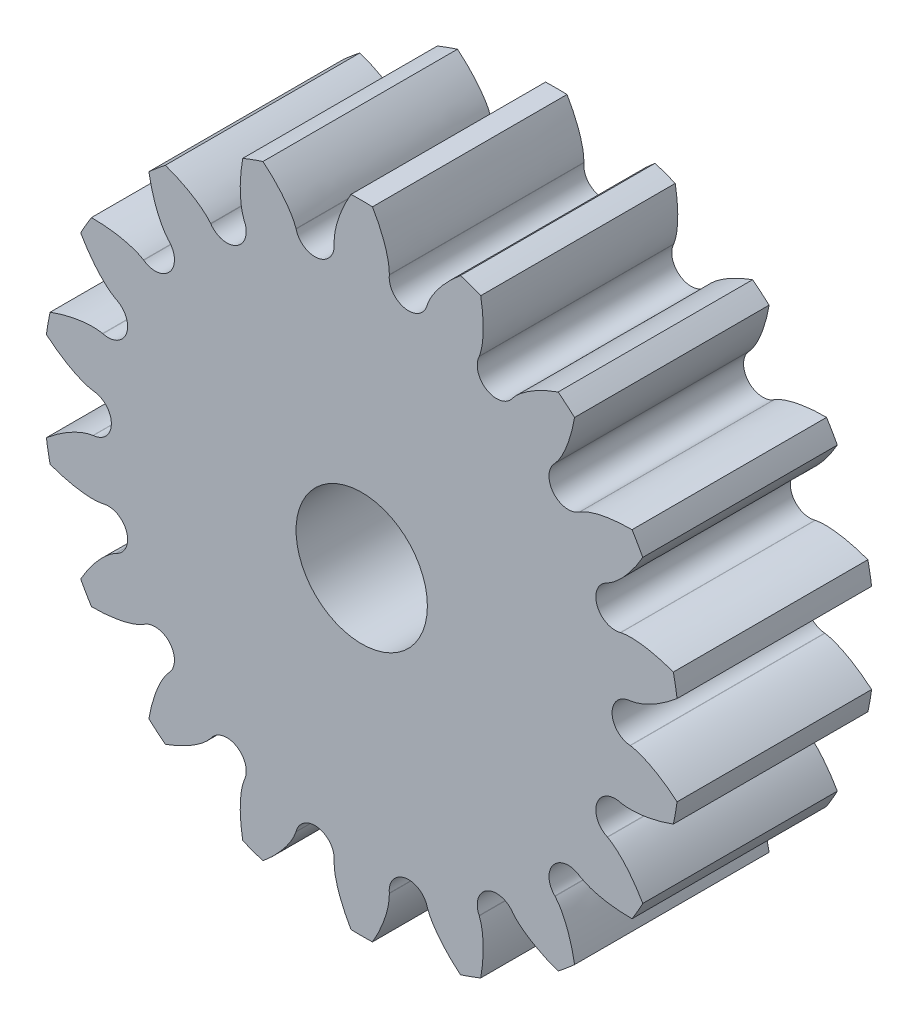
from build123d import *

# Parameters (mm, degrees)
SKETCH3_R                      = 3.8735
SKETCH3_R_2                    = 1.016
BASE_DEPTH                     = 3.0099
HALF_TOOTH_DEPTH               = 3.0099
PATTERN_OF_TOOTH_COUNT         = 18
PATTERN_OF_TOOTH_COPY_1_DEPTH  = 3.0099
PATTERN_OF_TOOTH_COPY_2_DEPTH  = 3.0099
PATTERN_OF_TOOTH_COPY_3_DEPTH  = 3.0099
PATTERN_OF_TOOTH_COPY_4_DEPTH  = 3.0099
PATTERN_OF_TOOTH_COPY_5_DEPTH  = 3.0099
PATTERN_OF_TOOTH_COPY_6_DEPTH  = 3.0099
PATTERN_OF_TOOTH_COPY_7_DEPTH  = 3.0099
PATTERN_OF_TOOTH_COPY_8_DEPTH  = 3.0099
PATTERN_OF_TOOTH_COPY_9_DEPTH  = 3.0099
PATTERN_OF_TOOTH_COPY_10_DEPTH = 3.0099
PATTERN_OF_TOOTH_COPY_11_DEPTH = 3.0099
PATTERN_OF_TOOTH_COPY_12_DEPTH = 3.0099
PATTERN_OF_TOOTH_COPY_13_DEPTH = 3.0099
PATTERN_OF_TOOTH_COPY_14_DEPTH = 3.0099
PATTERN_OF_TOOTH_COPY_15_DEPTH = 3.0099
PATTERN_OF_TOOTH_COPY_16_DEPTH = 3.0099
PATTERN_OF_TOOTH_COPY_17_DEPTH = 3.0099


with BuildPart() as part:
    # Sketch3 → Base (new body)
    with BuildSketch(Plane.XY):
        Circle(SKETCH3_R)
        Circle(SKETCH3_R_2, mode=Mode.SUBTRACT)
    extrude(amount=BASE_DEPTH)

    # Sketch2 → Half tooth (add)
    with BuildSketch(Plane.XY):
        with BuildLine():
            Line((0, 4.9276), (0, 3.8735))
            ThreePointArc((0, 3.8735), (0.33759777, 3.858760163), (0.672626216, 3.814652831))
            ThreePointArc((0.672626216, 3.814652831), (0.485562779, 3.929154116), (0.426627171, 4.14041194))
            Line((0.426627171, 4.14041194), (0.427145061, 4.145438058))
            add(Edge.make_bspline(
                [(0.166315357, 4.924792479), (0.258862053, 4.766378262), (0.375827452, 4.512802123), (0.428422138, 4.238585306), (0.427145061, 4.145438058)],
                knots=[0, 0, 0, 0, 0.664051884, 1, 1, 1, 1], degree=3))
            ThreePointArc((0.166315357, 4.924792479), (0.083169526, 4.92689807), (0, 4.9276))
        make_face()
    half_tooth = extrude(amount=HALF_TOOTH_DEPTH)

    # Mirror of half tooth: Half tooth across plane
    add(half_tooth.mirror(Plane.ZY))

    # Pattern of tooth: Half tooth ×18 about axis
    pattern_of_tooth_axis = Axis((0, 0, 0), (0, 0, -1))
    for i in range(1, PATTERN_OF_TOOTH_COUNT):
        add(half_tooth.rotate(pattern_of_tooth_axis, i * 360 / PATTERN_OF_TOOTH_COUNT))

    # Pattern of tooth copy 1 sketch → Pattern of tooth copy 1 (add)
    with BuildSketch(Plane(origin=(0, 0, 0), x_dir=(-0.9396926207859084, 0.3420201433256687, 0), z_dir=(0, 0, 1))):
        with BuildLine():
            Line((0, -4.9276), (0, -3.8735))
            ThreePointArc((0, -3.8735), (0.33759777, -3.858760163), (0.672626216, -3.814652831))
            ThreePointArc((0.672626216, -3.814652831), (0.485562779, -3.929154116), (0.426627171, -4.14041194))
            Line((0.426627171, -4.14041194), (0.427145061, -4.145438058))
            add(Edge.make_bspline(
                [(0.166315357, -4.924792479), (0.258862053, -4.766378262), (0.375827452, -4.512802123), (0.428422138, -4.238585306), (0.427145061, -4.145438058)],
                knots=[0, 0, 0, 0, 0.664051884, 1, 1, 1, 1], degree=3))
            ThreePointArc((0.166315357, -4.924792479), (0.083169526, -4.92689807), (0, -4.9276))
        make_face()
    extrude(amount=PATTERN_OF_TOOTH_COPY_1_DEPTH)

    # Pattern of tooth copy 2 sketch → Pattern of tooth copy 2 (add)
    with BuildSketch(Plane(origin=(0, 0, 0), x_dir=(-0.766044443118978, 0.6427876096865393, 0), z_dir=(0, 0, 1))):
        with BuildLine():
            Line((0, -4.9276), (0, -3.8735))
            ThreePointArc((0, -3.8735), (0.33759777, -3.858760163), (0.672626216, -3.814652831))
            ThreePointArc((0.672626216, -3.814652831), (0.485562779, -3.929154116), (0.426627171, -4.14041194))
            Line((0.426627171, -4.14041194), (0.427145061, -4.145438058))
            add(Edge.make_bspline(
                [(0.166315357, -4.924792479), (0.258862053, -4.766378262), (0.375827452, -4.512802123), (0.428422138, -4.238585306), (0.427145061, -4.145438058)],
                knots=[0, 0, 0, 0, 0.664051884, 1, 1, 1, 1], degree=3))
            ThreePointArc((0.166315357, -4.924792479), (0.083169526, -4.92689807), (0, -4.9276))
        make_face()
    extrude(amount=PATTERN_OF_TOOTH_COPY_2_DEPTH)

    # Pattern of tooth copy 3 sketch → Pattern of tooth copy 3 (add)
    with BuildSketch(Plane(origin=(0, 0, 0), x_dir=(-0.5000000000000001, 0.8660254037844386, 0), z_dir=(0, 0, 1))):
        with BuildLine():
            Line((0, -4.9276), (0, -3.8735))
            ThreePointArc((0, -3.8735), (0.33759777, -3.858760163), (0.672626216, -3.814652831))
            ThreePointArc((0.672626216, -3.814652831), (0.485562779, -3.929154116), (0.426627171, -4.14041194))
            Line((0.426627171, -4.14041194), (0.427145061, -4.145438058))
            add(Edge.make_bspline(
                [(0.166315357, -4.924792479), (0.258862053, -4.766378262), (0.375827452, -4.512802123), (0.428422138, -4.238585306), (0.427145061, -4.145438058)],
                knots=[0, 0, 0, 0, 0.664051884, 1, 1, 1, 1], degree=3))
            ThreePointArc((0.166315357, -4.924792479), (0.083169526, -4.92689807), (0, -4.9276))
        make_face()
    extrude(amount=PATTERN_OF_TOOTH_COPY_3_DEPTH)

    # Pattern of tooth copy 4 sketch → Pattern of tooth copy 4 (add)
    with BuildSketch(Plane(origin=(0, 0, 0), x_dir=(-0.17364817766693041, 0.984807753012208, 0), z_dir=(0, 0, 1))):
        with BuildLine():
            Line((0, -4.9276), (0, -3.8735))
            ThreePointArc((0, -3.8735), (0.33759777, -3.858760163), (0.672626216, -3.814652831))
            ThreePointArc((0.672626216, -3.814652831), (0.485562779, -3.929154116), (0.426627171, -4.14041194))
            Line((0.426627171, -4.14041194), (0.427145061, -4.145438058))
            add(Edge.make_bspline(
                [(0.166315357, -4.924792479), (0.258862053, -4.766378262), (0.375827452, -4.512802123), (0.428422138, -4.238585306), (0.427145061, -4.145438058)],
                knots=[0, 0, 0, 0, 0.664051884, 1, 1, 1, 1], degree=3))
            ThreePointArc((0.166315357, -4.924792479), (0.083169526, -4.92689807), (0, -4.9276))
        make_face()
    extrude(amount=PATTERN_OF_TOOTH_COPY_4_DEPTH)

    # Pattern of tooth copy 5 sketch → Pattern of tooth copy 5 (add)
    with BuildSketch(Plane(origin=(0, 0, 0), x_dir=(0.1736481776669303, 0.984807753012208, 0), z_dir=(0, 0, 1))):
        with BuildLine():
            Line((0, -4.9276), (0, -3.8735))
            ThreePointArc((0, -3.8735), (0.33759777, -3.858760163), (0.672626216, -3.814652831))
            ThreePointArc((0.672626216, -3.814652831), (0.485562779, -3.929154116), (0.426627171, -4.14041194))
            Line((0.426627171, -4.14041194), (0.427145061, -4.145438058))
            add(Edge.make_bspline(
                [(0.166315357, -4.924792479), (0.258862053, -4.766378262), (0.375827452, -4.512802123), (0.428422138, -4.238585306), (0.427145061, -4.145438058)],
                knots=[0, 0, 0, 0, 0.664051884, 1, 1, 1, 1], degree=3))
            ThreePointArc((0.166315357, -4.924792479), (0.083169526, -4.92689807), (0, -4.9276))
        make_face()
    extrude(amount=PATTERN_OF_TOOTH_COPY_5_DEPTH)

    # Pattern of tooth copy 6 sketch → Pattern of tooth copy 6 (add)
    with BuildSketch(Plane(origin=(0, 0, 0), x_dir=(0.4999999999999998, 0.8660254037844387, 0), z_dir=(0, 0, 1))):
        with BuildLine():
            Line((0, -4.9276), (0, -3.8735))
            ThreePointArc((0, -3.8735), (0.33759777, -3.858760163), (0.672626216, -3.814652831))
            ThreePointArc((0.672626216, -3.814652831), (0.485562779, -3.929154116), (0.426627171, -4.14041194))
            Line((0.426627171, -4.14041194), (0.427145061, -4.145438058))
            add(Edge.make_bspline(
                [(0.166315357, -4.924792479), (0.258862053, -4.766378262), (0.375827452, -4.512802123), (0.428422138, -4.238585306), (0.427145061, -4.145438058)],
                knots=[0, 0, 0, 0, 0.664051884, 1, 1, 1, 1], degree=3))
            ThreePointArc((0.166315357, -4.924792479), (0.083169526, -4.92689807), (0, -4.9276))
        make_face()
    extrude(amount=PATTERN_OF_TOOTH_COPY_6_DEPTH)

    # Pattern of tooth copy 7 sketch → Pattern of tooth copy 7 (add)
    with BuildSketch(Plane(origin=(0, 0, 0), x_dir=(0.7660444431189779, 0.6427876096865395, 0), z_dir=(0, 0, 1))):
        with BuildLine():
            Line((0, -4.9276), (0, -3.8735))
            ThreePointArc((0, -3.8735), (0.33759777, -3.858760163), (0.672626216, -3.814652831))
            ThreePointArc((0.672626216, -3.814652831), (0.485562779, -3.929154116), (0.426627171, -4.14041194))
            Line((0.426627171, -4.14041194), (0.427145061, -4.145438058))
            add(Edge.make_bspline(
                [(0.166315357, -4.924792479), (0.258862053, -4.766378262), (0.375827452, -4.512802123), (0.428422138, -4.238585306), (0.427145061, -4.145438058)],
                knots=[0, 0, 0, 0, 0.664051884, 1, 1, 1, 1], degree=3))
            ThreePointArc((0.166315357, -4.924792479), (0.083169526, -4.92689807), (0, -4.9276))
        make_face()
    extrude(amount=PATTERN_OF_TOOTH_COPY_7_DEPTH)

    # Pattern of tooth copy 8 sketch → Pattern of tooth copy 8 (add)
    with BuildSketch(Plane(origin=(0, 0, 0), x_dir=(0.9396926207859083, 0.3420201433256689, 0), z_dir=(0, 0, 1))):
        with BuildLine():
            Line((0, -4.9276), (0, -3.8735))
            ThreePointArc((0, -3.8735), (0.33759777, -3.858760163), (0.672626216, -3.814652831))
            ThreePointArc((0.672626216, -3.814652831), (0.485562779, -3.929154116), (0.426627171, -4.14041194))
            Line((0.426627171, -4.14041194), (0.427145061, -4.145438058))
            add(Edge.make_bspline(
                [(0.166315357, -4.924792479), (0.258862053, -4.766378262), (0.375827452, -4.512802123), (0.428422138, -4.238585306), (0.427145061, -4.145438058)],
                knots=[0, 0, 0, 0, 0.664051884, 1, 1, 1, 1], degree=3))
            ThreePointArc((0.166315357, -4.924792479), (0.083169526, -4.92689807), (0, -4.9276))
        make_face()
    extrude(amount=PATTERN_OF_TOOTH_COPY_8_DEPTH)

    # Pattern of tooth copy 9 sketch → Pattern of tooth copy 9 (add)
    with BuildSketch(Plane.XY):
        with BuildLine():
            Line((0, -4.9276), (0, -3.8735))
            ThreePointArc((0, -3.8735), (0.33759777, -3.858760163), (0.672626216, -3.814652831))
            ThreePointArc((0.672626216, -3.814652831), (0.485562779, -3.929154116), (0.426627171, -4.14041194))
            Line((0.426627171, -4.14041194), (0.427145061, -4.145438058))
            add(Edge.make_bspline(
                [(0.166315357, -4.924792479), (0.258862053, -4.766378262), (0.375827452, -4.512802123), (0.428422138, -4.238585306), (0.427145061, -4.145438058)],
                knots=[0, 0, 0, 0, 0.664051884, 1, 1, 1, 1], degree=3))
            ThreePointArc((0.166315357, -4.924792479), (0.083169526, -4.92689807), (0, -4.9276))
        make_face()
    extrude(amount=PATTERN_OF_TOOTH_COPY_9_DEPTH)

    # Pattern of tooth copy 10 sketch → Pattern of tooth copy 10 (add)
    with BuildSketch(Plane(origin=(0, 0, 0), x_dir=(0.9396926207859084, -0.34202014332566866, 0), z_dir=(0, 0, 1))):
        with BuildLine():
            Line((0, -4.9276), (0, -3.8735))
            ThreePointArc((0, -3.8735), (0.33759777, -3.858760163), (0.672626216, -3.814652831))
            ThreePointArc((0.672626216, -3.814652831), (0.485562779, -3.929154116), (0.426627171, -4.14041194))
            Line((0.426627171, -4.14041194), (0.427145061, -4.145438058))
            add(Edge.make_bspline(
                [(0.166315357, -4.924792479), (0.258862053, -4.766378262), (0.375827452, -4.512802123), (0.428422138, -4.238585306), (0.427145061, -4.145438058)],
                knots=[0, 0, 0, 0, 0.664051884, 1, 1, 1, 1], degree=3))
            ThreePointArc((0.166315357, -4.924792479), (0.083169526, -4.92689807), (0, -4.9276))
        make_face()
    extrude(amount=PATTERN_OF_TOOTH_COPY_10_DEPTH)

    # Pattern of tooth copy 11 sketch → Pattern of tooth copy 11 (add)
    with BuildSketch(Plane(origin=(0, 0, 0), x_dir=(0.766044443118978, -0.6427876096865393, 0), z_dir=(0, 0, 1))):
        with BuildLine():
            Line((0, -4.9276), (0, -3.8735))
            ThreePointArc((0, -3.8735), (0.33759777, -3.858760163), (0.672626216, -3.814652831))
            ThreePointArc((0.672626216, -3.814652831), (0.485562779, -3.929154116), (0.426627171, -4.14041194))
            Line((0.426627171, -4.14041194), (0.427145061, -4.145438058))
            add(Edge.make_bspline(
                [(0.166315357, -4.924792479), (0.258862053, -4.766378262), (0.375827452, -4.512802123), (0.428422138, -4.238585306), (0.427145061, -4.145438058)],
                knots=[0, 0, 0, 0, 0.664051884, 1, 1, 1, 1], degree=3))
            ThreePointArc((0.166315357, -4.924792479), (0.083169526, -4.92689807), (0, -4.9276))
        make_face()
    extrude(amount=PATTERN_OF_TOOTH_COPY_11_DEPTH)

    # Pattern of tooth copy 12 sketch → Pattern of tooth copy 12 (add)
    with BuildSketch(Plane(origin=(0, 0, 0), x_dir=(0.5000000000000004, -0.8660254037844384, 0), z_dir=(0, 0, 1))):
        with BuildLine():
            Line((0, -4.9276), (0, -3.8735))
            ThreePointArc((0, -3.8735), (0.33759777, -3.858760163), (0.672626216, -3.814652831))
            ThreePointArc((0.672626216, -3.814652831), (0.485562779, -3.929154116), (0.426627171, -4.14041194))
            Line((0.426627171, -4.14041194), (0.427145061, -4.145438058))
            add(Edge.make_bspline(
                [(0.166315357, -4.924792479), (0.258862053, -4.766378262), (0.375827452, -4.512802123), (0.428422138, -4.238585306), (0.427145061, -4.145438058)],
                knots=[0, 0, 0, 0, 0.664051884, 1, 1, 1, 1], degree=3))
            ThreePointArc((0.166315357, -4.924792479), (0.083169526, -4.92689807), (0, -4.9276))
        make_face()
    extrude(amount=PATTERN_OF_TOOTH_COPY_12_DEPTH)

    # Pattern of tooth copy 13 sketch → Pattern of tooth copy 13 (add)
    with BuildSketch(Plane(origin=(0, 0, 0), x_dir=(0.17364817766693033, -0.984807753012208, 0), z_dir=(0, 0, 1))):
        with BuildLine():
            Line((0, -4.9276), (0, -3.8735))
            ThreePointArc((0, -3.8735), (0.33759777, -3.858760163), (0.672626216, -3.814652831))
            ThreePointArc((0.672626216, -3.814652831), (0.485562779, -3.929154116), (0.426627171, -4.14041194))
            Line((0.426627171, -4.14041194), (0.427145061, -4.145438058))
            add(Edge.make_bspline(
                [(0.166315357, -4.924792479), (0.258862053, -4.766378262), (0.375827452, -4.512802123), (0.428422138, -4.238585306), (0.427145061, -4.145438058)],
                knots=[0, 0, 0, 0, 0.664051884, 1, 1, 1, 1], degree=3))
            ThreePointArc((0.166315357, -4.924792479), (0.083169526, -4.92689807), (0, -4.9276))
        make_face()
    extrude(amount=PATTERN_OF_TOOTH_COPY_13_DEPTH)

    # Pattern of tooth copy 14 sketch → Pattern of tooth copy 14 (add)
    with BuildSketch(Plane(origin=(0, 0, 0), x_dir=(-0.17364817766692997, -0.9848077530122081, 0), z_dir=(0, 0, 1))):
        with BuildLine():
            Line((0, -4.9276), (0, -3.8735))
            ThreePointArc((0, -3.8735), (0.33759777, -3.858760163), (0.672626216, -3.814652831))
            ThreePointArc((0.672626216, -3.814652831), (0.485562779, -3.929154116), (0.426627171, -4.14041194))
            Line((0.426627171, -4.14041194), (0.427145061, -4.145438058))
            add(Edge.make_bspline(
                [(0.166315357, -4.924792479), (0.258862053, -4.766378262), (0.375827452, -4.512802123), (0.428422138, -4.238585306), (0.427145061, -4.145438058)],
                knots=[0, 0, 0, 0, 0.664051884, 1, 1, 1, 1], degree=3))
            ThreePointArc((0.166315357, -4.924792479), (0.083169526, -4.92689807), (0, -4.9276))
        make_face()
    extrude(amount=PATTERN_OF_TOOTH_COPY_14_DEPTH)

    # Pattern of tooth copy 15 sketch → Pattern of tooth copy 15 (add)
    with BuildSketch(Plane(origin=(0, 0, 0), x_dir=(-0.5000000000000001, -0.8660254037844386, 0), z_dir=(0, 0, 1))):
        with BuildLine():
            Line((0, -4.9276), (0, -3.8735))
            ThreePointArc((0, -3.8735), (0.33759777, -3.858760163), (0.672626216, -3.814652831))
            ThreePointArc((0.672626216, -3.814652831), (0.485562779, -3.929154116), (0.426627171, -4.14041194))
            Line((0.426627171, -4.14041194), (0.427145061, -4.145438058))
            add(Edge.make_bspline(
                [(0.166315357, -4.924792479), (0.258862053, -4.766378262), (0.375827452, -4.512802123), (0.428422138, -4.238585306), (0.427145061, -4.145438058)],
                knots=[0, 0, 0, 0, 0.664051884, 1, 1, 1, 1], degree=3))
            ThreePointArc((0.166315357, -4.924792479), (0.083169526, -4.92689807), (0, -4.9276))
        make_face()
    extrude(amount=PATTERN_OF_TOOTH_COPY_15_DEPTH)

    # Pattern of tooth copy 16 sketch → Pattern of tooth copy 16 (add)
    with BuildSketch(Plane(origin=(0, 0, 0), x_dir=(-0.7660444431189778, -0.6427876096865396, 0), z_dir=(0, 0, 1))):
        with BuildLine():
            Line((0, -4.9276), (0, -3.8735))
            ThreePointArc((0, -3.8735), (0.33759777, -3.858760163), (0.672626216, -3.814652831))
            ThreePointArc((0.672626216, -3.814652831), (0.485562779, -3.929154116), (0.426627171, -4.14041194))
            Line((0.426627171, -4.14041194), (0.427145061, -4.145438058))
            add(Edge.make_bspline(
                [(0.166315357, -4.924792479), (0.258862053, -4.766378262), (0.375827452, -4.512802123), (0.428422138, -4.238585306), (0.427145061, -4.145438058)],
                knots=[0, 0, 0, 0, 0.664051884, 1, 1, 1, 1], degree=3))
            ThreePointArc((0.166315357, -4.924792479), (0.083169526, -4.92689807), (0, -4.9276))
        make_face()
    extrude(amount=PATTERN_OF_TOOTH_COPY_16_DEPTH)

    # Pattern of tooth copy 17 sketch → Pattern of tooth copy 17 (add)
    with BuildSketch(Plane(origin=(0, 0, 0), x_dir=(-0.9396926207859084, -0.3420201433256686, 0), z_dir=(0, 0, 1))):
        with BuildLine():
            Line((0, -4.9276), (0, -3.8735))
            ThreePointArc((0, -3.8735), (0.33759777, -3.858760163), (0.672626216, -3.814652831))
            ThreePointArc((0.672626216, -3.814652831), (0.485562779, -3.929154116), (0.426627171, -4.14041194))
            Line((0.426627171, -4.14041194), (0.427145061, -4.145438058))
            add(Edge.make_bspline(
                [(0.166315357, -4.924792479), (0.258862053, -4.766378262), (0.375827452, -4.512802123), (0.428422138, -4.238585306), (0.427145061, -4.145438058)],
                knots=[0, 0, 0, 0, 0.664051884, 1, 1, 1, 1], degree=3))
            ThreePointArc((0.166315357, -4.924792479), (0.083169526, -4.92689807), (0, -4.9276))
        make_face()
    extrude(amount=PATTERN_OF_TOOTH_COPY_17_DEPTH)


solid = part.part
